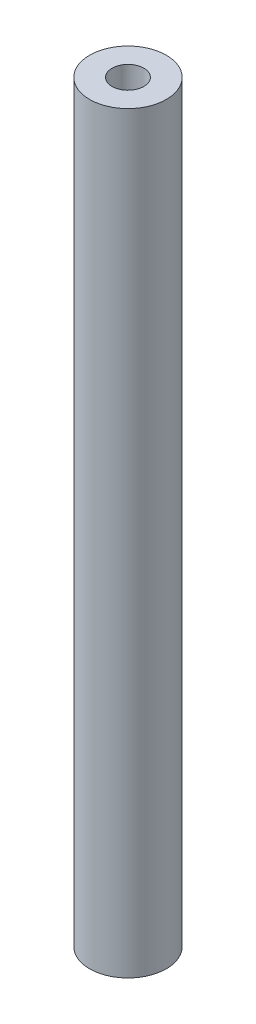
ISO-10303-21;
HEADER;
FILE_DESCRIPTION(('STEP AP214'),'2;1');
FILE_NAME('part.step','',(''),(''),'','','');
FILE_SCHEMA(('AUTOMOTIVE_DESIGN { 1 0 10303 214 1 1 1 1 }'));
ENDSEC;
DATA;
#1=APPLICATION_CONTEXT('core data for automotive mechanical design processes');
#2=APPLICATION_PROTOCOL_DEFINITION('international standard','automotive_design',2000,#1);
#3=PRODUCT_CONTEXT('',#1,'mechanical');
#4=PRODUCT('Part','Part','',(#3));
#5=PRODUCT_RELATED_PRODUCT_CATEGORY('part','',(#4));
#6=PRODUCT_DEFINITION_FORMATION('','',#4);
#7=PRODUCT_DEFINITION_CONTEXT('part definition',#1,'design');
#8=PRODUCT_DEFINITION('design','',#6,#7);
#9=PRODUCT_DEFINITION_SHAPE('','',#8);
#10=(LENGTH_UNIT() NAMED_UNIT(*) SI_UNIT(.MILLI.,.METRE.));
#11=(NAMED_UNIT(*) PLANE_ANGLE_UNIT() SI_UNIT($,.RADIAN.));
#12=(NAMED_UNIT(*) SI_UNIT($,.STERADIAN.) SOLID_ANGLE_UNIT());
#13=UNCERTAINTY_MEASURE_WITH_UNIT(LENGTH_MEASURE(1.E-05),#10,'distance_accuracy_value','');
#14=(GEOMETRIC_REPRESENTATION_CONTEXT(3) GLOBAL_UNCERTAINTY_ASSIGNED_CONTEXT((#13)) GLOBAL_UNIT_ASSIGNED_CONTEXT((#10,
#11,#12)) REPRESENTATION_CONTEXT('',''));
#15=CARTESIAN_POINT('',(0.,0.,0.));
#16=DIRECTION('',(0.,0.,1.));
#17=DIRECTION('',(1.,0.,0.));
#18=AXIS2_PLACEMENT_3D('',#15,#16,#17);
#19=CARTESIAN_POINT('',(-874.171620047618,420.172634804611,1135.60325221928));
#20=DIRECTION('',(0.,-1.,0.));
#21=DIRECTION('',(0.,0.,-1.));
#22=AXIS2_PLACEMENT_3D('',#19,#20,#21);
#23=CYLINDRICAL_SURFACE('',#22,6.34999999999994);
#24=CARTESIAN_POINT('',(-874.171620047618,277.550649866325,1135.60325221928));
#25=DIRECTION('',(0.,1.,0.));
#26=DIRECTION('',(0.,0.,1.));
#27=AXIS2_PLACEMENT_3D('',#24,#25,#26);
#28=CIRCLE('',#27,6.34999999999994);
#29=CARTESIAN_POINT('',(-874.171620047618,277.550649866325,1141.95325221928));
#30=VERTEX_POINT('',#29);
#31=EDGE_CURVE('E42',#30,#30,#28,.T.);
#32=ORIENTED_EDGE('',*,*,#31,.T.);
#33=EDGE_LOOP('',(#32));
#34=FACE_BOUND('',#33,.T.);
#35=CARTESIAN_POINT('',(-874.171620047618,402.212122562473,1135.60325221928));
#36=DIRECTION('',(0.,1.,0.));
#37=DIRECTION('',(0.,0.,1.));
#38=AXIS2_PLACEMENT_3D('',#35,#36,#37);
#39=CIRCLE('',#38,6.34999999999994);
#40=CARTESIAN_POINT('',(-874.171620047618,402.212122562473,1141.95325221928));
#41=VERTEX_POINT('',#40);
#42=EDGE_CURVE('E10',#41,#41,#39,.T.);
#43=ORIENTED_EDGE('',*,*,#42,.F.);
#44=EDGE_LOOP('',(#43));
#45=FACE_BOUND('',#44,.T.);
#46=ADVANCED_FACE('F40',(#34,#45),#23,.T.);
#47=CARTESIAN_POINT('',(-874.171620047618,277.550649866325,1135.60325221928));
#48=DIRECTION('',(0.,1.,0.));
#49=DIRECTION('',(0.,0.,1.));
#50=AXIS2_PLACEMENT_3D('',#47,#48,#49);
#51=PLANE('',#50);
#52=CARTESIAN_POINT('',(-874.171620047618,277.550649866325,1135.60325221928));
#53=DIRECTION('',(0.,-1.,0.));
#54=DIRECTION('',(0.,0.,-1.));
#55=AXIS2_PLACEMENT_3D('',#52,#53,#54);
#56=CIRCLE('',#55,2.62890000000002);
#57=CARTESIAN_POINT('',(-874.171620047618,277.550649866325,1132.97435221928));
#58=VERTEX_POINT('',#57);
#59=EDGE_CURVE('E59',#58,#58,#56,.T.);
#60=ORIENTED_EDGE('',*,*,#59,.F.);
#61=EDGE_LOOP('',(#60));
#62=FACE_BOUND('',#61,.T.);
#63=ORIENTED_EDGE('',*,*,#31,.F.);
#64=EDGE_LOOP('',(#63));
#65=FACE_BOUND('',#64,.T.);
#66=ADVANCED_FACE('F71',(#62,#65),#51,.F.);
#67=CARTESIAN_POINT('',(-909.027870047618,402.212122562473,702.615752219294));
#68=DIRECTION('',(0.,1.,0.));
#69=DIRECTION('',(0.,0.,1.));
#70=AXIS2_PLACEMENT_3D('',#67,#68,#69);
#71=PLANE('',#70);
#72=CARTESIAN_POINT('',(-874.171620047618,402.212122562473,1135.60325221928));
#73=DIRECTION('',(0.,1.,0.));
#74=DIRECTION('',(0.,0.,1.));
#75=AXIS2_PLACEMENT_3D('',#72,#73,#74);
#76=CIRCLE('',#75,2.62890000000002);
#77=CARTESIAN_POINT('',(-874.171620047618,402.212122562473,1138.23215221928));
#78=VERTEX_POINT('',#77);
#79=EDGE_CURVE('E55',#78,#78,#76,.T.);
#80=ORIENTED_EDGE('',*,*,#79,.F.);
#81=EDGE_LOOP('',(#80));
#82=FACE_BOUND('',#81,.T.);
#83=ORIENTED_EDGE('',*,*,#42,.T.);
#84=EDGE_LOOP('',(#83));
#85=FACE_BOUND('',#84,.T.);
#86=ADVANCED_FACE('F39',(#82,#85),#71,.T.);
#87=CARTESIAN_POINT('',(-874.171620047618,376.812122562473,1135.60325221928));
#88=DIRECTION('',(0.,1.,0.));
#89=DIRECTION('',(0.,0.,1.));
#90=AXIS2_PLACEMENT_3D('',#87,#88,#89);
#91=CYLINDRICAL_SURFACE('',#90,2.62890000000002);
#92=CARTESIAN_POINT('',(-874.171620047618,376.812122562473,1135.60325221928));
#93=DIRECTION('',(0.,1.,0.));
#94=DIRECTION('',(0.,0.,1.));
#95=AXIS2_PLACEMENT_3D('',#92,#93,#94);
#96=CIRCLE('',#95,2.62890000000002);
#97=CARTESIAN_POINT('',(-874.171620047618,376.812122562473,1138.23215221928));
#98=VERTEX_POINT('',#97);
#99=EDGE_CURVE('E48',#98,#98,#96,.T.);
#100=ORIENTED_EDGE('',*,*,#99,.F.);
#101=EDGE_LOOP('',(#100));
#102=FACE_BOUND('',#101,.T.);
#103=ORIENTED_EDGE('',*,*,#79,.T.);
#104=EDGE_LOOP('',(#103));
#105=FACE_BOUND('',#104,.T.);
#106=ADVANCED_FACE('F82',(#102,#105),#91,.F.);
#107=CARTESIAN_POINT('',(-874.171620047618,376.812122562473,1135.60325221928));
#108=DIRECTION('',(0.,1.,0.));
#109=DIRECTION('',(0.,0.,1.));
#110=AXIS2_PLACEMENT_3D('',#107,#108,#109);
#111=PLANE('',#110);
#112=ORIENTED_EDGE('',*,*,#99,.T.);
#113=EDGE_LOOP('',(#112));
#114=FACE_BOUND('',#113,.T.);
#115=ADVANCED_FACE('F66',(#114),#111,.T.);
#116=CARTESIAN_POINT('',(-874.171620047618,302.950649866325,1135.60325221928));
#117=DIRECTION('',(0.,-1.,0.));
#118=DIRECTION('',(0.,0.,-1.));
#119=AXIS2_PLACEMENT_3D('',#116,#117,#118);
#120=CYLINDRICAL_SURFACE('',#119,2.62890000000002);
#121=CARTESIAN_POINT('',(-874.171620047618,302.950649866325,1135.60325221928));
#122=DIRECTION('',(0.,-1.,0.));
#123=DIRECTION('',(0.,0.,-1.));
#124=AXIS2_PLACEMENT_3D('',#121,#122,#123);
#125=CIRCLE('',#124,2.62890000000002);
#126=CARTESIAN_POINT('',(-874.171620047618,302.950649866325,1132.97435221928));
#127=VERTEX_POINT('',#126);
#128=EDGE_CURVE('E57',#127,#127,#125,.T.);
#129=ORIENTED_EDGE('',*,*,#128,.F.);
#130=EDGE_LOOP('',(#129));
#131=FACE_BOUND('',#130,.T.);
#132=ORIENTED_EDGE('',*,*,#59,.T.);
#133=EDGE_LOOP('',(#132));
#134=FACE_BOUND('',#133,.T.);
#135=ADVANCED_FACE('F67',(#131,#134),#120,.F.);
#136=CARTESIAN_POINT('',(-874.171620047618,302.950649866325,1135.60325221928));
#137=DIRECTION('',(0.,-1.,0.));
#138=DIRECTION('',(0.,0.,-1.));
#139=AXIS2_PLACEMENT_3D('',#136,#137,#138);
#140=PLANE('',#139);
#141=ORIENTED_EDGE('',*,*,#128,.T.);
#142=EDGE_LOOP('',(#141));
#143=FACE_BOUND('',#142,.T.);
#144=ADVANCED_FACE('F63',(#143),#140,.T.);
#145=CLOSED_SHELL('',(#46,#66,#86,#106,#115,#135,#144));
#146=MANIFOLD_SOLID_BREP('B2',#145);
#147=ADVANCED_BREP_SHAPE_REPRESENTATION('',(#18,#146),#14);
#148=SHAPE_DEFINITION_REPRESENTATION(#9,#147);
ENDSEC;
END-ISO-10303-21;
